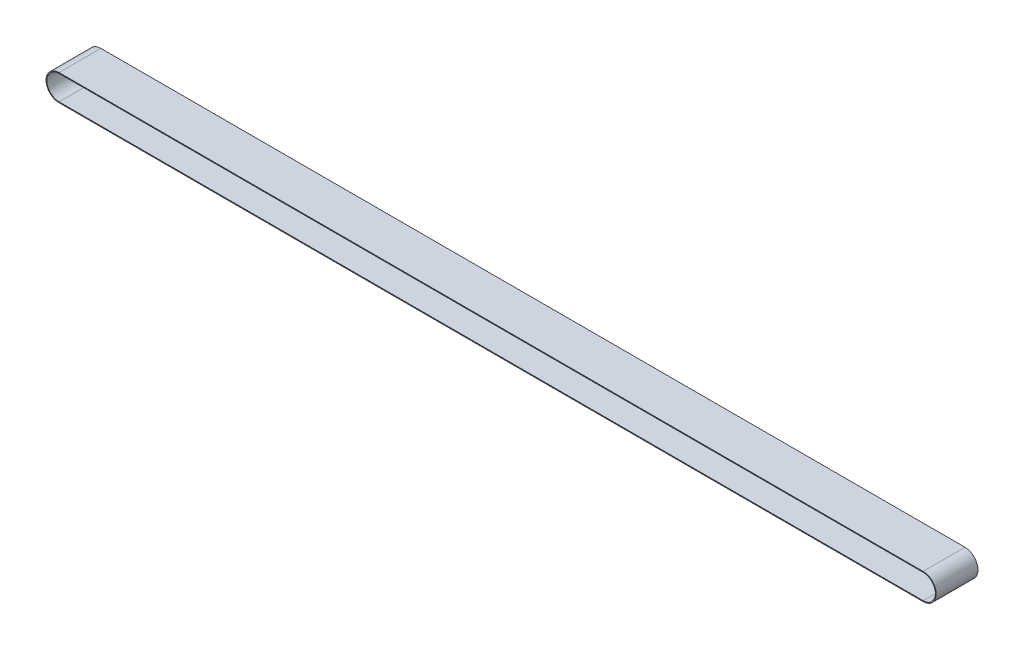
from build123d import *

# Parameters (mm, degrees)
EXTRUDE_THIN1_DEPTH = 37.5


with BuildPart() as part:
    # Sketch2 → Extrude-Thin1 (new, symmetric)
    with BuildSketch(Plane.XY):
        with BuildLine():
            Line((-51.5, 159.5), (1498.5, 159.5))
            ThreePointArc((1498.5, 159.5), (1522, 136), (1498.5, 112.5))
            Line((1498.5, 112.5), (-51.5, 112.5))
            ThreePointArc((-51.5, 112.5), (-75, 136), (-51.5, 159.5))
        make_face()
        with BuildLine():
            Line((-51.5, 158), (1498.5, 158))
            ThreePointArc((1498.5, 158), (1520.5, 136), (1498.5, 114))
            Line((1498.5, 114), (-51.5, 114))
            ThreePointArc((-51.5, 114), (-73.5, 136), (-51.5, 158))
        make_face(mode=Mode.SUBTRACT)
    extrude(amount=EXTRUDE_THIN1_DEPTH, both=True)


solid = part.part
